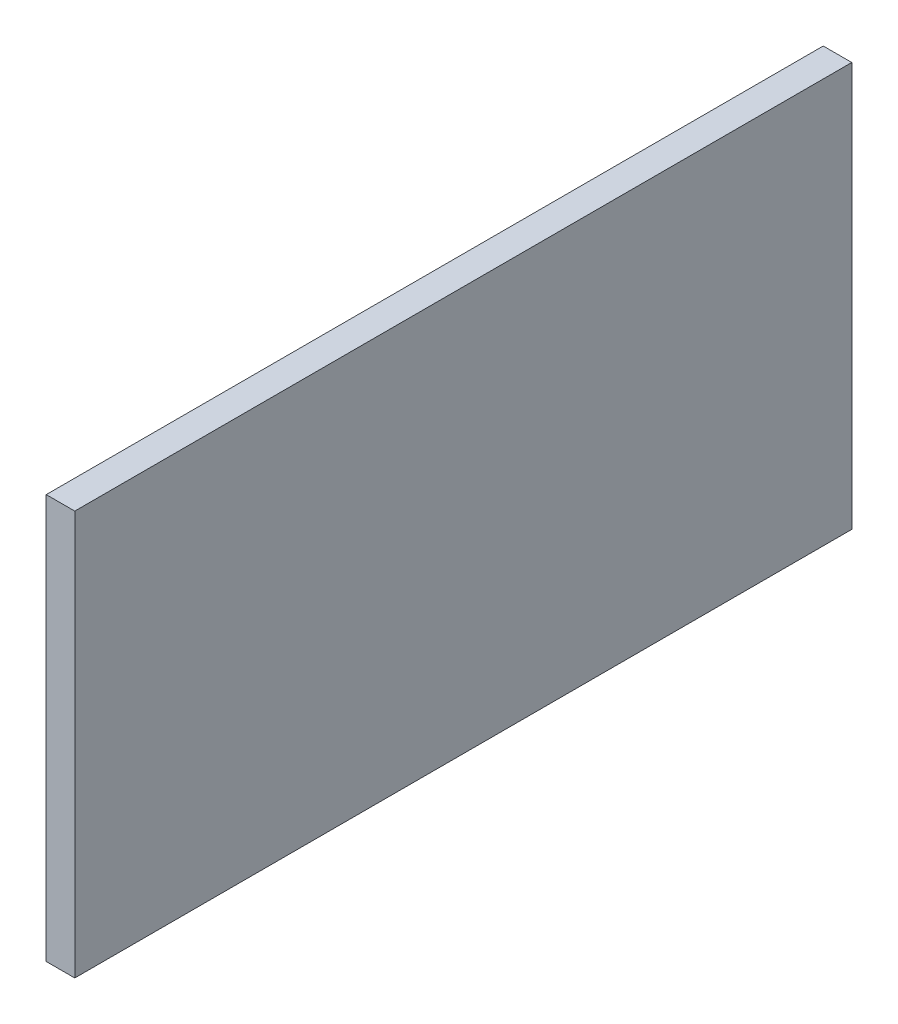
ISO-10303-21;
HEADER;
FILE_DESCRIPTION(('STEP AP214'),'2;1');
FILE_NAME('part.step','',(''),(''),'','','');
FILE_SCHEMA(('AUTOMOTIVE_DESIGN { 1 0 10303 214 1 1 1 1 }'));
ENDSEC;
DATA;
#1=APPLICATION_CONTEXT('core data for automotive mechanical design processes');
#2=APPLICATION_PROTOCOL_DEFINITION('international standard','automotive_design',2000,#1);
#3=PRODUCT_CONTEXT('',#1,'mechanical');
#4=PRODUCT('Part','Part','',(#3));
#5=PRODUCT_RELATED_PRODUCT_CATEGORY('part','',(#4));
#6=PRODUCT_DEFINITION_FORMATION('','',#4);
#7=PRODUCT_DEFINITION_CONTEXT('part definition',#1,'design');
#8=PRODUCT_DEFINITION('design','',#6,#7);
#9=PRODUCT_DEFINITION_SHAPE('','',#8);
#10=(LENGTH_UNIT() NAMED_UNIT(*) SI_UNIT(.MILLI.,.METRE.));
#11=(NAMED_UNIT(*) PLANE_ANGLE_UNIT() SI_UNIT($,.RADIAN.));
#12=(NAMED_UNIT(*) SI_UNIT($,.STERADIAN.) SOLID_ANGLE_UNIT());
#13=UNCERTAINTY_MEASURE_WITH_UNIT(LENGTH_MEASURE(1.E-05),#10,'distance_accuracy_value','');
#14=(GEOMETRIC_REPRESENTATION_CONTEXT(3) GLOBAL_UNCERTAINTY_ASSIGNED_CONTEXT((#13)) GLOBAL_UNIT_ASSIGNED_CONTEXT((#10,
#11,#12)) REPRESENTATION_CONTEXT('',''));
#15=CARTESIAN_POINT('',(0.,0.,0.));
#16=DIRECTION('',(0.,0.,1.));
#17=DIRECTION('',(1.,0.,0.));
#18=AXIS2_PLACEMENT_3D('',#15,#16,#17);
#19=CARTESIAN_POINT('',(263.000000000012,932.531682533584,-490.));
#20=DIRECTION('',(-1.,0.,0.));
#21=DIRECTION('',(0.,-1.,0.));
#22=AXIS2_PLACEMENT_3D('',#19,#20,#21);
#23=PLANE('',#22);
#24=DIRECTION('',(0.,-1.,0.));
#25=VECTOR('',#24,1.);
#26=CARTESIAN_POINT('',(263.000000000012,932.531682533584,0.));
#27=LINE('',#26,#25);
#28=CARTESIAN_POINT('',(263.000000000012,932.531682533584,0.));
#29=VERTEX_POINT('',#28);
#30=CARTESIAN_POINT('',(263.000000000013,677.531682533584,0.));
#31=VERTEX_POINT('',#30);
#32=EDGE_CURVE('E97',#29,#31,#27,.T.);
#33=ORIENTED_EDGE('',*,*,#32,.F.);
#34=DIRECTION('',(0.,0.,1.));
#35=VECTOR('',#34,1.);
#36=CARTESIAN_POINT('',(263.000000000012,932.531682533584,-490.));
#37=LINE('',#36,#35);
#38=CARTESIAN_POINT('',(263.000000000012,932.531682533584,-490.));
#39=VERTEX_POINT('',#38);
#40=EDGE_CURVE('E11',#39,#29,#37,.T.);
#41=ORIENTED_EDGE('',*,*,#40,.F.);
#42=DIRECTION('',(0.,-1.,0.));
#43=VECTOR('',#42,1.);
#44=CARTESIAN_POINT('',(263.000000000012,932.531682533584,-490.));
#45=LINE('',#44,#43);
#46=CARTESIAN_POINT('',(263.000000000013,677.531682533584,-490.));
#47=VERTEX_POINT('',#46);
#48=EDGE_CURVE('E91',#39,#47,#45,.T.);
#49=ORIENTED_EDGE('',*,*,#48,.T.);
#50=DIRECTION('',(0.,0.,1.));
#51=VECTOR('',#50,1.);
#52=CARTESIAN_POINT('',(263.000000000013,677.531682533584,-490.));
#53=LINE('',#52,#51);
#54=EDGE_CURVE('E36',#47,#31,#53,.T.);
#55=ORIENTED_EDGE('',*,*,#54,.T.);
#56=EDGE_LOOP('',(#33,#41,#49,#55));
#57=FACE_BOUND('',#56,.T.);
#58=ADVANCED_FACE('F33',(#57),#23,.T.);
#59=CARTESIAN_POINT('',(263.000000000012,932.531682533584,-490.));
#60=DIRECTION('',(0.,1.,0.));
#61=DIRECTION('',(0.,0.,1.));
#62=AXIS2_PLACEMENT_3D('',#59,#60,#61);
#63=PLANE('',#62);
#64=DIRECTION('',(-1.,0.,0.));
#65=VECTOR('',#64,1.);
#66=CARTESIAN_POINT('',(263.000000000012,932.531682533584,0.));
#67=LINE('',#66,#65);
#68=CARTESIAN_POINT('',(281.000000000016,932.531682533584,0.));
#69=VERTEX_POINT('',#68);
#70=EDGE_CURVE('E93',#69,#29,#67,.T.);
#71=ORIENTED_EDGE('',*,*,#70,.F.);
#72=DIRECTION('',(0.,0.,1.));
#73=VECTOR('',#72,1.);
#74=CARTESIAN_POINT('',(281.000000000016,932.531682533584,-490.));
#75=LINE('',#74,#73);
#76=CARTESIAN_POINT('',(281.000000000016,932.531682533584,-490.));
#77=VERTEX_POINT('',#76);
#78=EDGE_CURVE('E42',#77,#69,#75,.T.);
#79=ORIENTED_EDGE('',*,*,#78,.F.);
#80=DIRECTION('',(-1.,0.,0.));
#81=VECTOR('',#80,1.);
#82=CARTESIAN_POINT('',(263.000000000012,932.531682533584,-490.));
#83=LINE('',#82,#81);
#84=EDGE_CURVE('E88',#77,#39,#83,.T.);
#85=ORIENTED_EDGE('',*,*,#84,.T.);
#86=ORIENTED_EDGE('',*,*,#40,.T.);
#87=EDGE_LOOP('',(#71,#79,#85,#86));
#88=FACE_BOUND('',#87,.T.);
#89=ADVANCED_FACE('F107',(#88),#63,.T.);
#90=CARTESIAN_POINT('',(281.000000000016,932.531682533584,-490.));
#91=DIRECTION('',(1.,0.,0.));
#92=DIRECTION('',(0.,1.,0.));
#93=AXIS2_PLACEMENT_3D('',#90,#91,#92);
#94=PLANE('',#93);
#95=DIRECTION('',(0.,1.,0.));
#96=VECTOR('',#95,1.);
#97=CARTESIAN_POINT('',(281.000000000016,932.531682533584,0.));
#98=LINE('',#97,#96);
#99=CARTESIAN_POINT('',(281.000000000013,677.531682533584,0.));
#100=VERTEX_POINT('',#99);
#101=EDGE_CURVE('E83',#100,#69,#98,.T.);
#102=ORIENTED_EDGE('',*,*,#101,.F.);
#103=DIRECTION('',(0.,0.,1.));
#104=VECTOR('',#103,1.);
#105=CARTESIAN_POINT('',(281.000000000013,677.531682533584,-490.));
#106=LINE('',#105,#104);
#107=CARTESIAN_POINT('',(281.000000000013,677.531682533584,-490.));
#108=VERTEX_POINT('',#107);
#109=EDGE_CURVE('E78',#108,#100,#106,.T.);
#110=ORIENTED_EDGE('',*,*,#109,.F.);
#111=DIRECTION('',(0.,1.,0.));
#112=VECTOR('',#111,1.);
#113=CARTESIAN_POINT('',(281.000000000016,932.531682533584,-490.));
#114=LINE('',#113,#112);
#115=EDGE_CURVE('E81',#108,#77,#114,.T.);
#116=ORIENTED_EDGE('',*,*,#115,.T.);
#117=ORIENTED_EDGE('',*,*,#78,.T.);
#118=EDGE_LOOP('',(#102,#110,#116,#117));
#119=FACE_BOUND('',#118,.T.);
#120=ADVANCED_FACE('F80',(#119),#94,.T.);
#121=CARTESIAN_POINT('',(263.000000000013,677.531682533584,-490.));
#122=DIRECTION('',(0.,-1.,0.));
#123=DIRECTION('',(0.,0.,-1.));
#124=AXIS2_PLACEMENT_3D('',#121,#122,#123);
#125=PLANE('',#124);
#126=DIRECTION('',(1.,0.,0.));
#127=VECTOR('',#126,1.);
#128=CARTESIAN_POINT('',(263.000000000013,677.531682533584,0.));
#129=LINE('',#128,#127);
#130=EDGE_CURVE('E100',#31,#100,#129,.T.);
#131=ORIENTED_EDGE('',*,*,#130,.F.);
#132=ORIENTED_EDGE('',*,*,#54,.F.);
#133=DIRECTION('',(1.,0.,0.));
#134=VECTOR('',#133,1.);
#135=CARTESIAN_POINT('',(263.000000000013,677.531682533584,-490.));
#136=LINE('',#135,#134);
#137=EDGE_CURVE('E87',#47,#108,#136,.T.);
#138=ORIENTED_EDGE('',*,*,#137,.T.);
#139=ORIENTED_EDGE('',*,*,#109,.T.);
#140=EDGE_LOOP('',(#131,#132,#138,#139));
#141=FACE_BOUND('',#140,.T.);
#142=ADVANCED_FACE('F90',(#141),#125,.T.);
#143=CARTESIAN_POINT('',(0.,0.,-490.));
#144=DIRECTION('',(0.,0.,1.));
#145=DIRECTION('',(1.,0.,0.));
#146=AXIS2_PLACEMENT_3D('',#143,#144,#145);
#147=PLANE('',#146);
#148=ORIENTED_EDGE('',*,*,#48,.F.);
#149=ORIENTED_EDGE('',*,*,#84,.F.);
#150=ORIENTED_EDGE('',*,*,#115,.F.);
#151=ORIENTED_EDGE('',*,*,#137,.F.);
#152=EDGE_LOOP('',(#148,#149,#150,#151));
#153=FACE_BOUND('',#152,.T.);
#154=ADVANCED_FACE('F86',(#153),#147,.F.);
#155=CARTESIAN_POINT('',(0.,0.,0.));
#156=DIRECTION('',(0.,0.,1.));
#157=DIRECTION('',(1.,0.,0.));
#158=AXIS2_PLACEMENT_3D('',#155,#156,#157);
#159=PLANE('',#158);
#160=ORIENTED_EDGE('',*,*,#32,.T.);
#161=ORIENTED_EDGE('',*,*,#130,.T.);
#162=ORIENTED_EDGE('',*,*,#101,.T.);
#163=ORIENTED_EDGE('',*,*,#70,.T.);
#164=EDGE_LOOP('',(#160,#161,#162,#163));
#165=FACE_BOUND('',#164,.T.);
#166=ADVANCED_FACE('F106',(#165),#159,.T.);
#167=CLOSED_SHELL('',(#58,#89,#120,#142,#154,#166));
#168=MANIFOLD_SOLID_BREP('B2',#167);
#169=ADVANCED_BREP_SHAPE_REPRESENTATION('',(#18,#168),#14);
#170=SHAPE_DEFINITION_REPRESENTATION(#9,#169);
ENDSEC;
END-ISO-10303-21;
